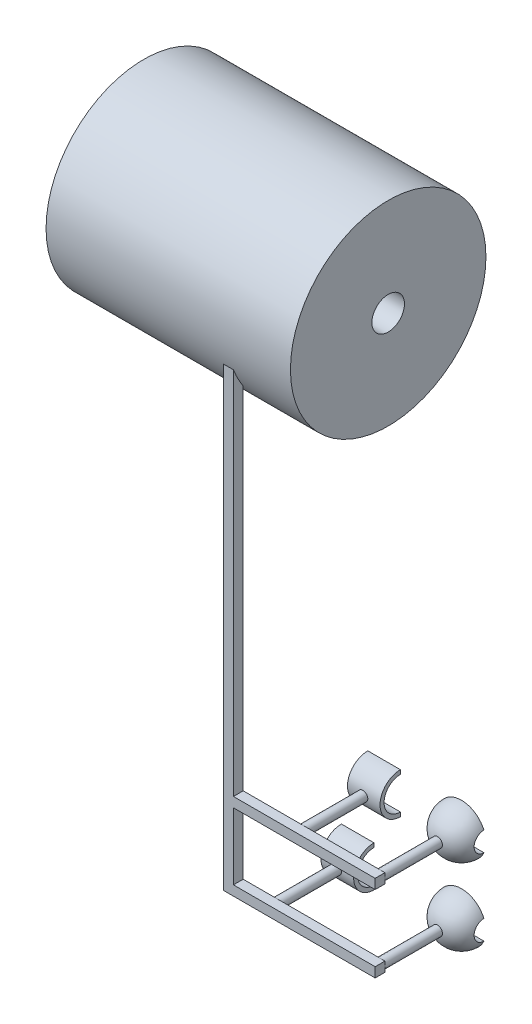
ISO-10303-21;
HEADER;
FILE_DESCRIPTION(('STEP AP214'),'2;1');
FILE_NAME('part.step','',(''),(''),'','','');
FILE_SCHEMA(('AUTOMOTIVE_DESIGN { 1 0 10303 214 1 1 1 1 }'));
ENDSEC;
DATA;
#1=APPLICATION_CONTEXT('core data for automotive mechanical design processes');
#2=APPLICATION_PROTOCOL_DEFINITION('international standard','automotive_design',2000,#1);
#3=PRODUCT_CONTEXT('',#1,'mechanical');
#4=PRODUCT('Part','Part','',(#3));
#5=PRODUCT_RELATED_PRODUCT_CATEGORY('part','',(#4));
#6=PRODUCT_DEFINITION_FORMATION('','',#4);
#7=PRODUCT_DEFINITION_CONTEXT('part definition',#1,'design');
#8=PRODUCT_DEFINITION('design','',#6,#7);
#9=PRODUCT_DEFINITION_SHAPE('','',#8);
#10=(LENGTH_UNIT() NAMED_UNIT(*) SI_UNIT(.MILLI.,.METRE.));
#11=(NAMED_UNIT(*) PLANE_ANGLE_UNIT() SI_UNIT($,.RADIAN.));
#12=(NAMED_UNIT(*) SI_UNIT($,.STERADIAN.) SOLID_ANGLE_UNIT());
#13=UNCERTAINTY_MEASURE_WITH_UNIT(LENGTH_MEASURE(1.E-05),#10,'distance_accuracy_value','');
#14=(GEOMETRIC_REPRESENTATION_CONTEXT(3) GLOBAL_UNCERTAINTY_ASSIGNED_CONTEXT((#13)) GLOBAL_UNIT_ASSIGNED_CONTEXT((#10,
#11,#12)) REPRESENTATION_CONTEXT('',''));
#15=CARTESIAN_POINT('',(0.,0.,0.));
#16=DIRECTION('',(0.,0.,1.));
#17=DIRECTION('',(1.,0.,0.));
#18=AXIS2_PLACEMENT_3D('',#15,#16,#17);
#19=CARTESIAN_POINT('',(0.,-47.,0.));
#20=DIRECTION('',(0.,0.,-1.));
#21=DIRECTION('',(-1.,0.,0.));
#22=AXIS2_PLACEMENT_3D('',#19,#20,#21);
#23=PLANE('',#22);
#24=DIRECTION('',(1.,0.,0.));
#25=VECTOR('',#24,1.);
#26=CARTESIAN_POINT('',(-195.,-41.,-1.36167772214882E-12));
#27=LINE('',#26,#25);
#28=CARTESIAN_POINT('',(-13.7477270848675,-41.,0.));
#29=VERTEX_POINT('',#28);
#30=CARTESIAN_POINT('',(-8.,-41.,0.));
#31=VERTEX_POINT('',#30);
#32=EDGE_CURVE('E12',#29,#31,#27,.T.);
#33=ORIENTED_EDGE('',*,*,#32,.F.);
#34=CARTESIAN_POINT('',(0.,-47.,0.));
#35=DIRECTION('',(0.,0.,-1.));
#36=DIRECTION('',(-1.,0.,0.));
#37=AXIS2_PLACEMENT_3D('',#34,#35,#36);
#38=CIRCLE('',#37,15.);
#39=CARTESIAN_POINT('',(13.7477270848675,-41.,0.));
#40=VERTEX_POINT('',#39);
#41=EDGE_CURVE('E212',#29,#40,#38,.T.);
#42=ORIENTED_EDGE('',*,*,#41,.T.);
#43=CARTESIAN_POINT('',(8.,-41.,0.));
#44=VERTEX_POINT('',#43);
#45=EDGE_CURVE('E48',#44,#40,#27,.T.);
#46=ORIENTED_EDGE('',*,*,#45,.F.);
#47=CARTESIAN_POINT('',(0.,-47.,0.));
#48=DIRECTION('',(0.,0.,1.));
#49=DIRECTION('',(-1.,0.,0.));
#50=AXIS2_PLACEMENT_3D('',#47,#48,#49);
#51=CIRCLE('',#50,10.);
#52=EDGE_CURVE('E218',#44,#31,#51,.T.);
#53=ORIENTED_EDGE('',*,*,#52,.T.);
#54=EDGE_LOOP('',(#33,#42,#46,#53));
#55=FACE_BOUND('',#54,.T.);
#56=ADVANCED_FACE('F44',(#55),#23,.T.);
#57=CARTESIAN_POINT('',(0.,0.,0.));
#58=DIRECTION('',(0.,0.,-1.));
#59=DIRECTION('',(-1.,0.,0.));
#60=AXIS2_PLACEMENT_3D('',#57,#58,#59);
#61=PLANE('',#60);
#62=DIRECTION('',(1.,0.,0.));
#63=VECTOR('',#62,1.);
#64=CARTESIAN_POINT('',(-195.,6.,1.36167772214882E-12));
#65=LINE('',#64,#63);
#66=CARTESIAN_POINT('',(-13.7477270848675,6.,0.));
#67=VERTEX_POINT('',#66);
#68=CARTESIAN_POINT('',(-8.,6.,0.));
#69=VERTEX_POINT('',#68);
#70=EDGE_CURVE('E205',#67,#69,#65,.T.);
#71=ORIENTED_EDGE('',*,*,#70,.F.);
#72=CARTESIAN_POINT('',(0.,0.,0.));
#73=DIRECTION('',(0.,0.,-1.));
#74=DIRECTION('',(-1.,0.,0.));
#75=AXIS2_PLACEMENT_3D('',#72,#73,#74);
#76=CIRCLE('',#75,15.);
#77=CARTESIAN_POINT('',(13.7477270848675,6.,0.));
#78=VERTEX_POINT('',#77);
#79=EDGE_CURVE('E234',#67,#78,#76,.T.);
#80=ORIENTED_EDGE('',*,*,#79,.T.);
#81=CARTESIAN_POINT('',(8.,6.,0.));
#82=VERTEX_POINT('',#81);
#83=EDGE_CURVE('E348',#82,#78,#65,.T.);
#84=ORIENTED_EDGE('',*,*,#83,.F.);
#85=CARTESIAN_POINT('',(0.,0.,0.));
#86=DIRECTION('',(0.,0.,1.));
#87=DIRECTION('',(-1.,0.,0.));
#88=AXIS2_PLACEMENT_3D('',#85,#86,#87);
#89=CIRCLE('',#88,10.);
#90=EDGE_CURVE('E233',#82,#69,#89,.T.);
#91=ORIENTED_EDGE('',*,*,#90,.T.);
#92=EDGE_LOOP('',(#71,#80,#84,#91));
#93=FACE_BOUND('',#92,.T.);
#94=ADVANCED_FACE('F450',(#93),#61,.T.);
#95=CARTESIAN_POINT('',(3.,251.37,50.));
#96=DIRECTION('',(0.,0.,1.));
#97=DIRECTION('',(1.,0.,0.));
#98=AXIS2_PLACEMENT_3D('',#95,#96,#97);
#99=PLANE('',#98);
#100=DIRECTION('',(-1.,0.,0.));
#101=VECTOR('',#100,1.);
#102=CARTESIAN_POINT('',(3.,3.,50.));
#103=LINE('',#102,#101);
#104=CARTESIAN_POINT('',(-47.5,3.,50.));
#105=VERTEX_POINT('',#104);
#106=CARTESIAN_POINT('',(-84.,2.99999999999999,50.));
#107=VERTEX_POINT('',#106);
#108=EDGE_CURVE('E243',#105,#107,#103,.T.);
#109=ORIENTED_EDGE('',*,*,#108,.F.);
#110=CARTESIAN_POINT('',(-47.5,0.,50.));
#111=DIRECTION('',(0.,0.,1.));
#112=DIRECTION('',(1.,0.,0.));
#113=AXIS2_PLACEMENT_3D('',#110,#111,#112);
#114=CIRCLE('',#113,3.);
#115=CARTESIAN_POINT('',(-47.5,-3.00000000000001,50.));
#116=VERTEX_POINT('',#115);
#117=EDGE_CURVE('E387',#105,#116,#114,.T.);
#118=ORIENTED_EDGE('',*,*,#117,.T.);
#119=DIRECTION('',(1.,0.,0.));
#120=VECTOR('',#119,1.);
#121=CARTESIAN_POINT('',(3.,-3.,50.));
#122=LINE('',#121,#120);
#123=CARTESIAN_POINT('',(-84.,-3.00000000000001,50.));
#124=VERTEX_POINT('',#123);
#125=EDGE_CURVE('E270',#124,#116,#122,.T.);
#126=ORIENTED_EDGE('',*,*,#125,.F.);
#127=DIRECTION('',(0.,1.,0.));
#128=VECTOR('',#127,1.);
#129=CARTESIAN_POINT('',(-84.,-44.,50.));
#130=LINE('',#129,#128);
#131=CARTESIAN_POINT('',(-84.,-44.,50.));
#132=VERTEX_POINT('',#131);
#133=EDGE_CURVE('E266',#132,#124,#130,.T.);
#134=ORIENTED_EDGE('',*,*,#133,.F.);
#135=DIRECTION('',(-1.,0.,0.));
#136=VECTOR('',#135,1.);
#137=CARTESIAN_POINT('',(3.00000000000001,-44.,50.));
#138=LINE('',#137,#136);
#139=CARTESIAN_POINT('',(-63.7,-44.,50.));
#140=VERTEX_POINT('',#139);
#141=EDGE_CURVE('E262',#140,#132,#138,.T.);
#142=ORIENTED_EDGE('',*,*,#141,.F.);
#143=CARTESIAN_POINT('',(-63.7,-47.,50.));
#144=DIRECTION('',(0.,0.,1.));
#145=DIRECTION('',(1.,0.,0.));
#146=AXIS2_PLACEMENT_3D('',#143,#144,#145);
#147=CIRCLE('',#146,3.00000000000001);
#148=CARTESIAN_POINT('',(-63.7,-50.,50.));
#149=VERTEX_POINT('',#148);
#150=EDGE_CURVE('E394',#140,#149,#147,.T.);
#151=ORIENTED_EDGE('',*,*,#150,.T.);
#152=DIRECTION('',(1.,0.,0.));
#153=VECTOR('',#152,1.);
#154=CARTESIAN_POINT('',(3.00000000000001,-50.,50.));
#155=LINE('',#154,#153);
#156=CARTESIAN_POINT('',(-90.,-50.,50.));
#157=VERTEX_POINT('',#156);
#158=EDGE_CURVE('E254',#157,#149,#155,.T.);
#159=ORIENTED_EDGE('',*,*,#158,.F.);
#160=DIRECTION('',(0.,-1.,0.));
#161=VECTOR('',#160,1.);
#162=CARTESIAN_POINT('',(-90.,-50.,50.));
#163=LINE('',#162,#161);
#164=CARTESIAN_POINT('',(-90.,218.203752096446,50.));
#165=VERTEX_POINT('',#164);
#166=EDGE_CURVE('E251',#165,#157,#163,.T.);
#167=ORIENTED_EDGE('',*,*,#166,.F.);
#168=DIRECTION('',(1.,0.,0.));
#169=VECTOR('',#168,1.);
#170=CARTESIAN_POINT('',(0.,218.203752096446,50.));
#171=LINE('',#170,#169);
#172=CARTESIAN_POINT('',(-84.,218.203752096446,50.));
#173=VERTEX_POINT('',#172);
#174=EDGE_CURVE('E330',#173,#165,#171,.F.);
#175=ORIENTED_EDGE('',*,*,#174,.F.);
#176=DIRECTION('',(0.,1.,0.));
#177=VECTOR('',#176,1.);
#178=CARTESIAN_POINT('',(-84.,2.99999999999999,50.));
#179=LINE('',#178,#177);
#180=EDGE_CURVE('E247',#107,#173,#179,.T.);
#181=ORIENTED_EDGE('',*,*,#180,.F.);
#182=EDGE_LOOP('',(#109,#118,#126,#134,#142,#151,#159,#167,#175,#181));
#183=FACE_BOUND('',#182,.T.);
#184=ADVANCED_FACE('F455',(#183),#99,.F.);
#185=CARTESIAN_POINT('',(0.,-3.,50.));
#186=VERTEX_POINT('',#185);
#187=EDGE_CURVE('E274',#116,#186,#122,.T.);
#188=ORIENTED_EDGE('',*,*,#187,.F.);
#189=EDGE_CURVE('E366',#116,#105,#114,.T.);
#190=ORIENTED_EDGE('',*,*,#189,.T.);
#191=CARTESIAN_POINT('',(0.,3.,50.));
#192=VERTEX_POINT('',#191);
#193=EDGE_CURVE('E248',#192,#105,#103,.T.);
#194=ORIENTED_EDGE('',*,*,#193,.F.);
#195=CARTESIAN_POINT('',(0.,0.,50.));
#196=DIRECTION('',(0.,0.,1.));
#197=DIRECTION('',(1.,0.,0.));
#198=AXIS2_PLACEMENT_3D('',#195,#196,#197);
#199=CIRCLE('',#198,3.);
#200=EDGE_CURVE('E344',#192,#186,#199,.T.);
#201=ORIENTED_EDGE('',*,*,#200,.T.);
#202=EDGE_LOOP('',(#188,#190,#194,#201));
#203=FACE_BOUND('',#202,.T.);
#204=ADVANCED_FACE('F590',(#203),#99,.F.);
#205=DIRECTION('',(0.,1.,0.));
#206=VECTOR('',#205,1.);
#207=CARTESIAN_POINT('',(3.00000000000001,-50.,50.));
#208=LINE('',#207,#206);
#209=CARTESIAN_POINT('',(3.00000000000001,-47.,50.));
#210=VERTEX_POINT('',#209);
#211=CARTESIAN_POINT('',(3.00000000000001,-44.,50.));
#212=VERTEX_POINT('',#211);
#213=EDGE_CURVE('E257',#210,#212,#208,.T.);
#214=ORIENTED_EDGE('',*,*,#213,.F.);
#215=CARTESIAN_POINT('',(0.,-47.,50.));
#216=DIRECTION('',(0.,0.,1.));
#217=DIRECTION('',(1.,0.,0.));
#218=AXIS2_PLACEMENT_3D('',#215,#216,#217);
#219=CIRCLE('',#218,3.);
#220=CARTESIAN_POINT('',(0.,-44.,50.));
#221=VERTEX_POINT('',#220);
#222=EDGE_CURVE('E225',#210,#221,#219,.T.);
#223=ORIENTED_EDGE('',*,*,#222,.T.);
#224=EDGE_CURVE('E263',#212,#221,#138,.T.);
#225=ORIENTED_EDGE('',*,*,#224,.F.);
#226=EDGE_LOOP('',(#214,#223,#225));
#227=FACE_BOUND('',#226,.T.);
#228=ADVANCED_FACE('F414',(#227),#99,.F.);
#229=CARTESIAN_POINT('',(0.,-50.,50.));
#230=VERTEX_POINT('',#229);
#231=EDGE_CURVE('E258',#149,#230,#155,.T.);
#232=ORIENTED_EDGE('',*,*,#231,.F.);
#233=EDGE_CURVE('E393',#149,#140,#147,.T.);
#234=ORIENTED_EDGE('',*,*,#233,.T.);
#235=EDGE_CURVE('E267',#221,#140,#138,.T.);
#236=ORIENTED_EDGE('',*,*,#235,.F.);
#237=EDGE_CURVE('E401',#221,#230,#219,.T.);
#238=ORIENTED_EDGE('',*,*,#237,.T.);
#239=EDGE_LOOP('',(#232,#234,#236,#238));
#240=FACE_BOUND('',#239,.T.);
#241=ADVANCED_FACE('F427',(#240),#99,.F.);
#242=DIRECTION('',(0.,1.,0.));
#243=VECTOR('',#242,1.);
#244=CARTESIAN_POINT('',(3.,-3.,50.));
#245=LINE('',#244,#243);
#246=CARTESIAN_POINT('',(3.,0.,50.));
#247=VERTEX_POINT('',#246);
#248=CARTESIAN_POINT('',(3.,3.,50.));
#249=VERTEX_POINT('',#248);
#250=EDGE_CURVE('E237',#247,#249,#245,.T.);
#251=ORIENTED_EDGE('',*,*,#250,.F.);
#252=CARTESIAN_POINT('',(0.,0.,50.));
#253=DIRECTION('',(0.,0.,1.));
#254=DIRECTION('',(1.,0.,0.));
#255=AXIS2_PLACEMENT_3D('',#252,#253,#254);
#256=CIRCLE('',#255,3.);
#257=EDGE_CURVE('E217',#247,#192,#256,.T.);
#258=ORIENTED_EDGE('',*,*,#257,.T.);
#259=EDGE_CURVE('E244',#249,#192,#103,.T.);
#260=ORIENTED_EDGE('',*,*,#259,.F.);
#261=EDGE_LOOP('',(#251,#258,#260));
#262=FACE_BOUND('',#261,.T.);
#263=ADVANCED_FACE('F610',(#262),#99,.F.);
#264=CARTESIAN_POINT('',(3.00000000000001,-50.,50.));
#265=VERTEX_POINT('',#264);
#266=EDGE_CURVE('E253',#230,#265,#155,.T.);
#267=ORIENTED_EDGE('',*,*,#266,.F.);
#268=EDGE_CURVE('E399',#230,#210,#219,.T.);
#269=ORIENTED_EDGE('',*,*,#268,.T.);
#270=EDGE_CURVE('E259',#265,#210,#208,.T.);
#271=ORIENTED_EDGE('',*,*,#270,.F.);
#272=EDGE_LOOP('',(#267,#269,#271));
#273=FACE_BOUND('',#272,.T.);
#274=ADVANCED_FACE('F412',(#273),#99,.F.);
#275=CARTESIAN_POINT('',(-45.,251.37,0.));
#276=DIRECTION('',(1.,0.,0.));
#277=DIRECTION('',(0.,0.,-1.));
#278=AXIS2_PLACEMENT_3D('',#275,#276,#277);
#279=PLANE('',#278);
#280=CARTESIAN_POINT('',(-45.,251.37,0.));
#281=DIRECTION('',(1.,0.,0.));
#282=DIRECTION('',(0.,0.,-1.));
#283=AXIS2_PLACEMENT_3D('',#280,#281,#282);
#284=CIRCLE('',#283,10.);
#285=CARTESIAN_POINT('',(-45.,251.37,-10.));
#286=VERTEX_POINT('',#285);
#287=EDGE_CURVE('E318',#286,#286,#284,.T.);
#288=ORIENTED_EDGE('',*,*,#287,.F.);
#289=EDGE_LOOP('',(#288));
#290=FACE_BOUND('',#289,.T.);
#291=CARTESIAN_POINT('',(-45.,251.37,0.));
#292=DIRECTION('',(1.,0.,0.));
#293=DIRECTION('',(0.,0.,-1.));
#294=AXIS2_PLACEMENT_3D('',#291,#292,#293);
#295=CIRCLE('',#294,60.);
#296=CARTESIAN_POINT('',(-45.,251.37,-60.));
#297=VERTEX_POINT('',#296);
#298=EDGE_CURVE('E327',#297,#297,#295,.T.);
#299=ORIENTED_EDGE('',*,*,#298,.T.);
#300=EDGE_LOOP('',(#299));
#301=FACE_BOUND('',#300,.T.);
#302=ADVANCED_FACE('F46',(#290,#301),#279,.T.);
#303=CARTESIAN_POINT('',(0.,251.37,0.));
#304=DIRECTION('',(1.,0.,0.));
#305=DIRECTION('',(0.,0.,-1.));
#306=AXIS2_PLACEMENT_3D('',#303,#304,#305);
#307=CYLINDRICAL_SURFACE('',#306,60.);
#308=DIRECTION('',(1.,0.,0.));
#309=VECTOR('',#308,1.);
#310=CARTESIAN_POINT('',(0.,229.829340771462,56.));
#311=LINE('',#310,#309);
#312=CARTESIAN_POINT('',(-84.,229.829340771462,56.));
#313=VERTEX_POINT('',#312);
#314=CARTESIAN_POINT('',(-90.,229.829340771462,56.));
#315=VERTEX_POINT('',#314);
#316=EDGE_CURVE('E339',#313,#315,#311,.F.);
#317=ORIENTED_EDGE('',*,*,#316,.F.);
#318=CARTESIAN_POINT('',(-84.,251.37,0.));
#319=DIRECTION('',(-1.,0.,0.));
#320=DIRECTION('',(0.,0.,1.));
#321=AXIS2_PLACEMENT_3D('',#318,#319,#320);
#322=CIRCLE('',#321,60.);
#323=EDGE_CURVE('E336',#313,#173,#322,.F.);
#324=ORIENTED_EDGE('',*,*,#323,.T.);
#325=ORIENTED_EDGE('',*,*,#174,.T.);
#326=CARTESIAN_POINT('',(-90.,251.37,0.));
#327=DIRECTION('',(1.,0.,0.));
#328=DIRECTION('',(0.,0.,-1.));
#329=AXIS2_PLACEMENT_3D('',#326,#327,#328);
#330=CIRCLE('',#329,60.);
#331=EDGE_CURVE('E333',#165,#315,#330,.F.);
#332=ORIENTED_EDGE('',*,*,#331,.T.);
#333=EDGE_LOOP('',(#317,#324,#325,#332));
#334=FACE_BOUND('',#333,.T.);
#335=CARTESIAN_POINT('',(-195.,251.37,0.));
#336=DIRECTION('',(1.,0.,0.));
#337=DIRECTION('',(0.,0.,-1.));
#338=AXIS2_PLACEMENT_3D('',#335,#336,#337);
#339=CIRCLE('',#338,60.);
#340=CARTESIAN_POINT('',(-195.,251.37,-60.));
#341=VERTEX_POINT('',#340);
#342=EDGE_CURVE('E324',#341,#341,#339,.T.);
#343=ORIENTED_EDGE('',*,*,#342,.T.);
#344=EDGE_LOOP('',(#343));
#345=FACE_BOUND('',#344,.T.);
#346=ORIENTED_EDGE('',*,*,#298,.F.);
#347=EDGE_LOOP('',(#346));
#348=FACE_BOUND('',#347,.T.);
#349=ADVANCED_FACE('F628',(#334,#345,#348),#307,.T.);
#350=CARTESIAN_POINT('',(-195.,251.37,0.));
#351=DIRECTION('',(-1.,0.,0.));
#352=DIRECTION('',(0.,0.,1.));
#353=AXIS2_PLACEMENT_3D('',#350,#351,#352);
#354=PLANE('',#353);
#355=ORIENTED_EDGE('',*,*,#342,.F.);
#356=EDGE_LOOP('',(#355));
#357=FACE_BOUND('',#356,.T.);
#358=ADVANCED_FACE('F636',(#357),#354,.T.);
#359=CARTESIAN_POINT('',(-65.,251.37,0.));
#360=DIRECTION('',(1.,0.,0.));
#361=DIRECTION('',(0.,0.,-1.));
#362=AXIS2_PLACEMENT_3D('',#359,#360,#361);
#363=CYLINDRICAL_SURFACE('',#362,10.);
#364=CARTESIAN_POINT('',(-65.,251.37,0.));
#365=DIRECTION('',(1.,0.,0.));
#366=DIRECTION('',(0.,0.,-1.));
#367=AXIS2_PLACEMENT_3D('',#364,#365,#366);
#368=CIRCLE('',#367,10.);
#369=CARTESIAN_POINT('',(-65.,251.37,-10.));
#370=VERTEX_POINT('',#369);
#371=EDGE_CURVE('E321',#370,#370,#368,.T.);
#372=ORIENTED_EDGE('',*,*,#371,.F.);
#373=EDGE_LOOP('',(#372));
#374=FACE_BOUND('',#373,.T.);
#375=ORIENTED_EDGE('',*,*,#287,.T.);
#376=EDGE_LOOP('',(#375));
#377=FACE_BOUND('',#376,.T.);
#378=ADVANCED_FACE('F643',(#374,#377),#363,.F.);
#379=CARTESIAN_POINT('',(-65.,251.37,0.));
#380=DIRECTION('',(1.,0.,0.));
#381=DIRECTION('',(0.,0.,-1.));
#382=AXIS2_PLACEMENT_3D('',#379,#380,#381);
#383=PLANE('',#382);
#384=ORIENTED_EDGE('',*,*,#371,.T.);
#385=EDGE_LOOP('',(#384));
#386=FACE_BOUND('',#385,.T.);
#387=ADVANCED_FACE('F650',(#386),#383,.T.);
#388=CARTESIAN_POINT('',(3.,-3.,56.));
#389=DIRECTION('',(-1.,0.,0.));
#390=DIRECTION('',(0.,0.,1.));
#391=AXIS2_PLACEMENT_3D('',#388,#389,#390);
#392=PLANE('',#391);
#393=CARTESIAN_POINT('',(3.,-3.,50.));
#394=VERTEX_POINT('',#393);
#395=EDGE_CURVE('E240',#394,#247,#245,.T.);
#396=ORIENTED_EDGE('',*,*,#395,.T.);
#397=ORIENTED_EDGE('',*,*,#250,.T.);
#398=DIRECTION('',(0.,0.,-1.));
#399=VECTOR('',#398,1.);
#400=CARTESIAN_POINT('',(3.,3.,56.));
#401=LINE('',#400,#399);
#402=CARTESIAN_POINT('',(3.,3.,56.));
#403=VERTEX_POINT('',#402);
#404=EDGE_CURVE('E315',#403,#249,#401,.T.);
#405=ORIENTED_EDGE('',*,*,#404,.F.);
#406=DIRECTION('',(0.,1.,0.));
#407=VECTOR('',#406,1.);
#408=CARTESIAN_POINT('',(3.,-3.,56.));
#409=LINE('',#408,#407);
#410=CARTESIAN_POINT('',(3.,-3.,56.));
#411=VERTEX_POINT('',#410);
#412=EDGE_CURVE('E273',#411,#403,#409,.T.);
#413=ORIENTED_EDGE('',*,*,#412,.F.);
#414=DIRECTION('',(0.,0.,-1.));
#415=VECTOR('',#414,1.);
#416=CARTESIAN_POINT('',(3.,-3.,56.));
#417=LINE('',#416,#415);
#418=EDGE_CURVE('E294',#411,#394,#417,.T.);
#419=ORIENTED_EDGE('',*,*,#418,.T.);
#420=EDGE_LOOP('',(#396,#397,#405,#413,#419));
#421=FACE_BOUND('',#420,.T.);
#422=ADVANCED_FACE('F657',(#421),#392,.F.);
#423=CARTESIAN_POINT('',(3.,3.,56.));
#424=DIRECTION('',(0.,-1.,0.));
#425=DIRECTION('',(1.,0.,0.));
#426=AXIS2_PLACEMENT_3D('',#423,#424,#425);
#427=PLANE('',#426);
#428=ORIENTED_EDGE('',*,*,#259,.T.);
#429=ORIENTED_EDGE('',*,*,#193,.T.);
#430=ORIENTED_EDGE('',*,*,#108,.T.);
#431=DIRECTION('',(0.,0.,-1.));
#432=VECTOR('',#431,1.);
#433=CARTESIAN_POINT('',(-84.,2.99999999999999,56.));
#434=LINE('',#433,#432);
#435=CARTESIAN_POINT('',(-84.,2.99999999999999,56.));
#436=VERTEX_POINT('',#435);
#437=EDGE_CURVE('E312',#436,#107,#434,.T.);
#438=ORIENTED_EDGE('',*,*,#437,.F.);
#439=DIRECTION('',(-1.,0.,0.));
#440=VECTOR('',#439,1.);
#441=CARTESIAN_POINT('',(3.,3.,56.));
#442=LINE('',#441,#440);
#443=EDGE_CURVE('E277',#403,#436,#442,.T.);
#444=ORIENTED_EDGE('',*,*,#443,.F.);
#445=ORIENTED_EDGE('',*,*,#404,.T.);
#446=EDGE_LOOP('',(#428,#429,#430,#438,#444,#445));
#447=FACE_BOUND('',#446,.T.);
#448=ADVANCED_FACE('F663',(#447),#427,.F.);
#449=CARTESIAN_POINT('',(-84.,2.99999999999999,56.));
#450=DIRECTION('',(-1.,0.,0.));
#451=DIRECTION('',(0.,0.,1.));
#452=AXIS2_PLACEMENT_3D('',#449,#450,#451);
#453=PLANE('',#452);
#454=ORIENTED_EDGE('',*,*,#323,.F.);
#455=DIRECTION('',(0.,1.,0.));
#456=VECTOR('',#455,1.);
#457=CARTESIAN_POINT('',(-84.,2.99999999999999,56.));
#458=LINE('',#457,#456);
#459=EDGE_CURVE('E279',#436,#313,#458,.T.);
#460=ORIENTED_EDGE('',*,*,#459,.F.);
#461=ORIENTED_EDGE('',*,*,#437,.T.);
#462=ORIENTED_EDGE('',*,*,#180,.T.);
#463=EDGE_LOOP('',(#454,#460,#461,#462));
#464=FACE_BOUND('',#463,.T.);
#465=ADVANCED_FACE('F671',(#464),#453,.F.);
#466=CARTESIAN_POINT('',(-90.,-50.,56.));
#467=DIRECTION('',(1.,0.,0.));
#468=DIRECTION('',(0.,0.,-1.));
#469=AXIS2_PLACEMENT_3D('',#466,#467,#468);
#470=PLANE('',#469);
#471=ORIENTED_EDGE('',*,*,#331,.F.);
#472=ORIENTED_EDGE('',*,*,#166,.T.);
#473=DIRECTION('',(0.,0.,-1.));
#474=VECTOR('',#473,1.);
#475=CARTESIAN_POINT('',(-90.,-50.,56.));
#476=LINE('',#475,#474);
#477=CARTESIAN_POINT('',(-90.,-50.,56.));
#478=VERTEX_POINT('',#477);
#479=EDGE_CURVE('E309',#478,#157,#476,.T.);
#480=ORIENTED_EDGE('',*,*,#479,.F.);
#481=DIRECTION('',(0.,-1.,0.));
#482=VECTOR('',#481,1.);
#483=CARTESIAN_POINT('',(-90.,-50.,56.));
#484=LINE('',#483,#482);
#485=EDGE_CURVE('E282',#315,#478,#484,.T.);
#486=ORIENTED_EDGE('',*,*,#485,.F.);
#487=EDGE_LOOP('',(#471,#472,#480,#486));
#488=FACE_BOUND('',#487,.T.);
#489=ADVANCED_FACE('F679',(#488),#470,.F.);
#490=CARTESIAN_POINT('',(3.00000000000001,-50.,56.));
#491=DIRECTION('',(0.,1.,0.));
#492=DIRECTION('',(-1.,0.,0.));
#493=AXIS2_PLACEMENT_3D('',#490,#491,#492);
#494=PLANE('',#493);
#495=ORIENTED_EDGE('',*,*,#158,.T.);
#496=ORIENTED_EDGE('',*,*,#231,.T.);
#497=ORIENTED_EDGE('',*,*,#266,.T.);
#498=DIRECTION('',(0.,0.,-1.));
#499=VECTOR('',#498,1.);
#500=CARTESIAN_POINT('',(3.00000000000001,-50.,56.));
#501=LINE('',#500,#499);
#502=CARTESIAN_POINT('',(3.00000000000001,-50.,56.));
#503=VERTEX_POINT('',#502);
#504=EDGE_CURVE('E306',#503,#265,#501,.T.);
#505=ORIENTED_EDGE('',*,*,#504,.F.);
#506=DIRECTION('',(1.,0.,0.));
#507=VECTOR('',#506,1.);
#508=CARTESIAN_POINT('',(3.00000000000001,-50.,56.));
#509=LINE('',#508,#507);
#510=EDGE_CURVE('E284',#478,#503,#509,.T.);
#511=ORIENTED_EDGE('',*,*,#510,.F.);
#512=ORIENTED_EDGE('',*,*,#479,.T.);
#513=EDGE_LOOP('',(#495,#496,#497,#505,#511,#512));
#514=FACE_BOUND('',#513,.T.);
#515=ADVANCED_FACE('F422',(#514),#494,.F.);
#516=CARTESIAN_POINT('',(3.00000000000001,-50.,56.));
#517=DIRECTION('',(-1.,0.,0.));
#518=DIRECTION('',(0.,0.,1.));
#519=AXIS2_PLACEMENT_3D('',#516,#517,#518);
#520=PLANE('',#519);
#521=ORIENTED_EDGE('',*,*,#270,.T.);
#522=ORIENTED_EDGE('',*,*,#213,.T.);
#523=DIRECTION('',(0.,0.,-1.));
#524=VECTOR('',#523,1.);
#525=CARTESIAN_POINT('',(3.00000000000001,-44.,56.));
#526=LINE('',#525,#524);
#527=CARTESIAN_POINT('',(3.00000000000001,-44.,56.));
#528=VERTEX_POINT('',#527);
#529=EDGE_CURVE('E303',#528,#212,#526,.T.);
#530=ORIENTED_EDGE('',*,*,#529,.F.);
#531=DIRECTION('',(0.,1.,0.));
#532=VECTOR('',#531,1.);
#533=CARTESIAN_POINT('',(3.00000000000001,-50.,56.));
#534=LINE('',#533,#532);
#535=EDGE_CURVE('E286',#503,#528,#534,.T.);
#536=ORIENTED_EDGE('',*,*,#535,.F.);
#537=ORIENTED_EDGE('',*,*,#504,.T.);
#538=EDGE_LOOP('',(#521,#522,#530,#536,#537));
#539=FACE_BOUND('',#538,.T.);
#540=ADVANCED_FACE('F417',(#539),#520,.F.);
#541=CARTESIAN_POINT('',(3.00000000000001,-44.,56.));
#542=DIRECTION('',(0.,-1.,0.));
#543=DIRECTION('',(1.,0.,0.));
#544=AXIS2_PLACEMENT_3D('',#541,#542,#543);
#545=PLANE('',#544);
#546=ORIENTED_EDGE('',*,*,#224,.T.);
#547=ORIENTED_EDGE('',*,*,#235,.T.);
#548=ORIENTED_EDGE('',*,*,#141,.T.);
#549=DIRECTION('',(0.,0.,-1.));
#550=VECTOR('',#549,1.);
#551=CARTESIAN_POINT('',(-84.,-44.,56.));
#552=LINE('',#551,#550);
#553=CARTESIAN_POINT('',(-84.,-44.,56.));
#554=VERTEX_POINT('',#553);
#555=EDGE_CURVE('E300',#554,#132,#552,.T.);
#556=ORIENTED_EDGE('',*,*,#555,.F.);
#557=DIRECTION('',(-1.,0.,0.));
#558=VECTOR('',#557,1.);
#559=CARTESIAN_POINT('',(3.00000000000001,-44.,56.));
#560=LINE('',#559,#558);
#561=EDGE_CURVE('E288',#528,#554,#560,.T.);
#562=ORIENTED_EDGE('',*,*,#561,.F.);
#563=ORIENTED_EDGE('',*,*,#529,.T.);
#564=EDGE_LOOP('',(#546,#547,#548,#556,#562,#563));
#565=FACE_BOUND('',#564,.T.);
#566=ADVANCED_FACE('F700',(#565),#545,.F.);
#567=CARTESIAN_POINT('',(-84.,-44.,56.));
#568=DIRECTION('',(-1.,0.,0.));
#569=DIRECTION('',(0.,0.,1.));
#570=AXIS2_PLACEMENT_3D('',#567,#568,#569);
#571=PLANE('',#570);
#572=ORIENTED_EDGE('',*,*,#133,.T.);
#573=DIRECTION('',(0.,0.,-1.));
#574=VECTOR('',#573,1.);
#575=CARTESIAN_POINT('',(-84.,-3.00000000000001,56.));
#576=LINE('',#575,#574);
#577=CARTESIAN_POINT('',(-84.,-3.00000000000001,56.));
#578=VERTEX_POINT('',#577);
#579=EDGE_CURVE('E297',#578,#124,#576,.T.);
#580=ORIENTED_EDGE('',*,*,#579,.F.);
#581=DIRECTION('',(0.,1.,0.));
#582=VECTOR('',#581,1.);
#583=CARTESIAN_POINT('',(-84.,-44.,56.));
#584=LINE('',#583,#582);
#585=EDGE_CURVE('E290',#554,#578,#584,.T.);
#586=ORIENTED_EDGE('',*,*,#585,.F.);
#587=ORIENTED_EDGE('',*,*,#555,.T.);
#588=EDGE_LOOP('',(#572,#580,#586,#587));
#589=FACE_BOUND('',#588,.T.);
#590=ADVANCED_FACE('F707',(#589),#571,.F.);
#591=CARTESIAN_POINT('',(3.,-3.,56.));
#592=DIRECTION('',(0.,1.,0.));
#593=DIRECTION('',(-1.,0.,0.));
#594=AXIS2_PLACEMENT_3D('',#591,#592,#593);
#595=PLANE('',#594);
#596=ORIENTED_EDGE('',*,*,#125,.T.);
#597=ORIENTED_EDGE('',*,*,#187,.T.);
#598=EDGE_CURVE('E269',#186,#394,#122,.T.);
#599=ORIENTED_EDGE('',*,*,#598,.T.);
#600=ORIENTED_EDGE('',*,*,#418,.F.);
#601=DIRECTION('',(1.,0.,0.));
#602=VECTOR('',#601,1.);
#603=CARTESIAN_POINT('',(3.,-3.,56.));
#604=LINE('',#603,#602);
#605=EDGE_CURVE('E292',#578,#411,#604,.T.);
#606=ORIENTED_EDGE('',*,*,#605,.F.);
#607=ORIENTED_EDGE('',*,*,#579,.T.);
#608=EDGE_LOOP('',(#596,#597,#599,#600,#606,#607));
#609=FACE_BOUND('',#608,.T.);
#610=ADVANCED_FACE('F715',(#609),#595,.F.);
#611=CARTESIAN_POINT('',(3.,251.37,56.));
#612=DIRECTION('',(0.,0.,1.));
#613=DIRECTION('',(1.,0.,0.));
#614=AXIS2_PLACEMENT_3D('',#611,#612,#613);
#615=PLANE('',#614);
#616=ORIENTED_EDGE('',*,*,#459,.T.);
#617=ORIENTED_EDGE('',*,*,#316,.T.);
#618=ORIENTED_EDGE('',*,*,#485,.T.);
#619=ORIENTED_EDGE('',*,*,#510,.T.);
#620=ORIENTED_EDGE('',*,*,#535,.T.);
#621=ORIENTED_EDGE('',*,*,#561,.T.);
#622=ORIENTED_EDGE('',*,*,#585,.T.);
#623=ORIENTED_EDGE('',*,*,#605,.T.);
#624=ORIENTED_EDGE('',*,*,#412,.T.);
#625=ORIENTED_EDGE('',*,*,#443,.T.);
#626=EDGE_LOOP('',(#616,#617,#618,#619,#620,#621,#622,#623,#624,#625));
#627=FACE_BOUND('',#626,.T.);
#628=ADVANCED_FACE('F723',(#627),#615,.T.);
#629=ORIENTED_EDGE('',*,*,#598,.F.);
#630=EDGE_CURVE('E341',#186,#247,#199,.T.);
#631=ORIENTED_EDGE('',*,*,#630,.T.);
#632=ORIENTED_EDGE('',*,*,#395,.F.);
#633=EDGE_LOOP('',(#629,#631,#632));
#634=FACE_BOUND('',#633,.T.);
#635=ADVANCED_FACE('F552',(#634),#99,.F.);
#636=CARTESIAN_POINT('',(0.,0.,0.));
#637=DIRECTION('',(0.,-1.,0.));
#638=DIRECTION('',(-1.,0.,0.));
#639=AXIS2_PLACEMENT_3D('',#636,#637,#638);
#640=SPHERICAL_SURFACE('',#639,10.);
#641=ORIENTED_EDGE('',*,*,#90,.F.);
#642=CARTESIAN_POINT('',(8.,0.,0.));
#643=DIRECTION('',(-1.,0.,0.));
#644=DIRECTION('',(0.,0.,1.));
#645=AXIS2_PLACEMENT_3D('',#642,#643,#644);
#646=CIRCLE('',#645,6.);
#647=CARTESIAN_POINT('',(8.,-6.,0.));
#648=VERTEX_POINT('',#647);
#649=EDGE_CURVE('E355',#82,#648,#646,.F.);
#650=ORIENTED_EDGE('',*,*,#649,.T.);
#651=CARTESIAN_POINT('',(-8.,-6.,0.));
#652=VERTEX_POINT('',#651);
#653=EDGE_CURVE('E229',#652,#648,#89,.T.);
#654=ORIENTED_EDGE('',*,*,#653,.F.);
#655=CARTESIAN_POINT('',(-8.,0.,0.));
#656=DIRECTION('',(1.,0.,0.));
#657=DIRECTION('',(0.,0.,-1.));
#658=AXIS2_PLACEMENT_3D('',#655,#656,#657);
#659=CIRCLE('',#658,6.);
#660=EDGE_CURVE('E375',#652,#69,#659,.F.);
#661=ORIENTED_EDGE('',*,*,#660,.T.);
#662=EDGE_LOOP('',(#641,#650,#654,#661));
#663=FACE_BOUND('',#662,.T.);
#664=ADVANCED_FACE('F363',(#663),#640,.F.);
#665=CARTESIAN_POINT('',(0.,0.,0.));
#666=DIRECTION('',(0.,-1.,0.));
#667=DIRECTION('',(1.,0.,0.));
#668=AXIS2_PLACEMENT_3D('',#665,#666,#667);
#669=SPHERICAL_SURFACE('',#668,15.);
#670=CARTESIAN_POINT('',(0.,0.,14.6969384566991));
#671=DIRECTION('',(0.,0.,-1.));
#672=DIRECTION('',(-1.,0.,0.));
#673=AXIS2_PLACEMENT_3D('',#670,#671,#672);
#674=CIRCLE('',#673,3.);
#675=CARTESIAN_POINT('',(-3.,0.,14.6969384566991));
#676=VERTEX_POINT('',#675);
#677=EDGE_CURVE('E228',#676,#676,#674,.T.);
#678=ORIENTED_EDGE('',*,*,#677,.T.);
#679=EDGE_LOOP('',(#678));
#680=FACE_BOUND('',#679,.T.);
#681=CARTESIAN_POINT('',(13.7477270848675,-6.,0.));
#682=VERTEX_POINT('',#681);
#683=CARTESIAN_POINT('',(-13.7477270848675,-6.,0.));
#684=VERTEX_POINT('',#683);
#685=EDGE_CURVE('E232',#682,#684,#76,.T.);
#686=ORIENTED_EDGE('',*,*,#685,.F.);
#687=CARTESIAN_POINT('',(13.7477270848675,0.,0.));
#688=DIRECTION('',(-1.,0.,0.));
#689=DIRECTION('',(0.,0.,1.));
#690=AXIS2_PLACEMENT_3D('',#687,#688,#689);
#691=CIRCLE('',#690,6.);
#692=EDGE_CURVE('E356',#682,#78,#691,.T.);
#693=ORIENTED_EDGE('',*,*,#692,.T.);
#694=ORIENTED_EDGE('',*,*,#79,.F.);
#695=CARTESIAN_POINT('',(-13.7477270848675,0.,0.));
#696=DIRECTION('',(1.,0.,0.));
#697=DIRECTION('',(0.,0.,-1.));
#698=AXIS2_PLACEMENT_3D('',#695,#696,#697);
#699=CIRCLE('',#698,6.);
#700=EDGE_CURVE('E373',#67,#684,#699,.T.);
#701=ORIENTED_EDGE('',*,*,#700,.T.);
#702=EDGE_LOOP('',(#686,#693,#694,#701));
#703=FACE_BOUND('',#702,.T.);
#704=ADVANCED_FACE('F378',(#680,#703),#669,.T.);
#705=DIRECTION('',(1.,0.,0.));
#706=VECTOR('',#705,1.);
#707=CARTESIAN_POINT('',(-195.,-6.,1.36167772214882E-12));
#708=LINE('',#707,#706);
#709=EDGE_CURVE('E347',#682,#648,#708,.F.);
#710=ORIENTED_EDGE('',*,*,#709,.F.);
#711=ORIENTED_EDGE('',*,*,#685,.T.);
#712=EDGE_CURVE('E345',#652,#684,#708,.F.);
#713=ORIENTED_EDGE('',*,*,#712,.F.);
#714=ORIENTED_EDGE('',*,*,#653,.T.);
#715=EDGE_LOOP('',(#710,#711,#713,#714));
#716=FACE_BOUND('',#715,.T.);
#717=ADVANCED_FACE('F369',(#716),#61,.T.);
#718=CARTESIAN_POINT('',(0.,0.,13.));
#719=DIRECTION('',(0.,0.,1.));
#720=DIRECTION('',(1.,0.,0.));
#721=AXIS2_PLACEMENT_3D('',#718,#719,#720);
#722=CYLINDRICAL_SURFACE('',#721,3.);
#723=ORIENTED_EDGE('',*,*,#257,.F.);
#724=ORIENTED_EDGE('',*,*,#630,.F.);
#725=ORIENTED_EDGE('',*,*,#200,.F.);
#726=EDGE_LOOP('',(#723,#724,#725));
#727=FACE_BOUND('',#726,.T.);
#728=ORIENTED_EDGE('',*,*,#677,.F.);
#729=EDGE_LOOP('',(#728));
#730=FACE_BOUND('',#729,.T.);
#731=ADVANCED_FACE('F445',(#727,#730),#722,.T.);
#732=CARTESIAN_POINT('',(0.,-47.,0.));
#733=DIRECTION('',(0.,1.,0.));
#734=DIRECTION('',(1.,0.,0.));
#735=AXIS2_PLACEMENT_3D('',#732,#733,#734);
#736=SPHERICAL_SURFACE('',#735,10.);
#737=ORIENTED_EDGE('',*,*,#52,.F.);
#738=CARTESIAN_POINT('',(8.,-47.,0.));
#739=DIRECTION('',(-1.,0.,0.));
#740=DIRECTION('',(0.,0.,1.));
#741=AXIS2_PLACEMENT_3D('',#738,#739,#740);
#742=CIRCLE('',#741,6.);
#743=CARTESIAN_POINT('',(8.00000000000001,-53.,0.));
#744=VERTEX_POINT('',#743);
#745=EDGE_CURVE('E379',#44,#744,#742,.F.);
#746=ORIENTED_EDGE('',*,*,#745,.T.);
#747=CARTESIAN_POINT('',(-8.,-53.,0.));
#748=VERTEX_POINT('',#747);
#749=EDGE_CURVE('E215',#748,#744,#51,.T.);
#750=ORIENTED_EDGE('',*,*,#749,.F.);
#751=CARTESIAN_POINT('',(-8.,-47.,0.));
#752=DIRECTION('',(1.,0.,0.));
#753=DIRECTION('',(0.,0.,-1.));
#754=AXIS2_PLACEMENT_3D('',#751,#752,#753);
#755=CIRCLE('',#754,6.);
#756=EDGE_CURVE('E58',#748,#31,#755,.F.);
#757=ORIENTED_EDGE('',*,*,#756,.T.);
#758=EDGE_LOOP('',(#737,#746,#750,#757));
#759=FACE_BOUND('',#758,.T.);
#760=ADVANCED_FACE('F438',(#759),#736,.F.);
#761=CARTESIAN_POINT('',(0.,-47.,0.));
#762=DIRECTION('',(0.,1.,0.));
#763=DIRECTION('',(-1.,0.,0.));
#764=AXIS2_PLACEMENT_3D('',#761,#762,#763);
#765=SPHERICAL_SURFACE('',#764,15.);
#766=CARTESIAN_POINT('',(0.,-47.,14.6969384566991));
#767=DIRECTION('',(0.,0.,-1.));
#768=DIRECTION('',(-1.,0.,0.));
#769=AXIS2_PLACEMENT_3D('',#766,#767,#768);
#770=CIRCLE('',#769,3.);
#771=CARTESIAN_POINT('',(-3.,-47.,14.6969384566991));
#772=VERTEX_POINT('',#771);
#773=EDGE_CURVE('E222',#772,#772,#770,.T.);
#774=ORIENTED_EDGE('',*,*,#773,.T.);
#775=EDGE_LOOP('',(#774));
#776=FACE_BOUND('',#775,.T.);
#777=CARTESIAN_POINT('',(13.7477270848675,-53.,0.));
#778=VERTEX_POINT('',#777);
#779=CARTESIAN_POINT('',(-13.7477270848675,-53.,0.));
#780=VERTEX_POINT('',#779);
#781=EDGE_CURVE('E210',#778,#780,#38,.T.);
#782=ORIENTED_EDGE('',*,*,#781,.F.);
#783=CARTESIAN_POINT('',(13.7477270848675,-47.,0.));
#784=DIRECTION('',(-1.,0.,0.));
#785=DIRECTION('',(0.,0.,1.));
#786=AXIS2_PLACEMENT_3D('',#783,#784,#785);
#787=CIRCLE('',#786,6.);
#788=EDGE_CURVE('E66',#778,#40,#787,.T.);
#789=ORIENTED_EDGE('',*,*,#788,.T.);
#790=ORIENTED_EDGE('',*,*,#41,.F.);
#791=CARTESIAN_POINT('',(-13.7477270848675,-47.,0.));
#792=DIRECTION('',(1.,0.,0.));
#793=DIRECTION('',(0.,0.,-1.));
#794=AXIS2_PLACEMENT_3D('',#791,#792,#793);
#795=CIRCLE('',#794,6.);
#796=EDGE_CURVE('E198',#29,#780,#795,.T.);
#797=ORIENTED_EDGE('',*,*,#796,.T.);
#798=EDGE_LOOP('',(#782,#789,#790,#797));
#799=FACE_BOUND('',#798,.T.);
#800=ADVANCED_FACE('F209',(#776,#799),#765,.T.);
#801=DIRECTION('',(1.,0.,0.));
#802=VECTOR('',#801,1.);
#803=CARTESIAN_POINT('',(-195.,-53.,-1.36167772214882E-12));
#804=LINE('',#803,#802);
#805=EDGE_CURVE('E204',#778,#744,#804,.F.);
#806=ORIENTED_EDGE('',*,*,#805,.F.);
#807=ORIENTED_EDGE('',*,*,#781,.T.);
#808=EDGE_CURVE('E195',#748,#780,#804,.F.);
#809=ORIENTED_EDGE('',*,*,#808,.F.);
#810=ORIENTED_EDGE('',*,*,#749,.T.);
#811=EDGE_LOOP('',(#806,#807,#809,#810));
#812=FACE_BOUND('',#811,.T.);
#813=ADVANCED_FACE('F214',(#812),#23,.T.);
#814=CARTESIAN_POINT('',(0.,-47.,13.));
#815=DIRECTION('',(0.,0.,1.));
#816=DIRECTION('',(1.,0.,0.));
#817=AXIS2_PLACEMENT_3D('',#814,#815,#816);
#818=CYLINDRICAL_SURFACE('',#817,3.);
#819=ORIENTED_EDGE('',*,*,#222,.F.);
#820=ORIENTED_EDGE('',*,*,#268,.F.);
#821=ORIENTED_EDGE('',*,*,#237,.F.);
#822=EDGE_LOOP('',(#819,#820,#821));
#823=FACE_BOUND('',#822,.T.);
#824=ORIENTED_EDGE('',*,*,#773,.F.);
#825=EDGE_LOOP('',(#824));
#826=FACE_BOUND('',#825,.T.);
#827=ADVANCED_FACE('F430',(#823,#826),#818,.T.);
#828=CARTESIAN_POINT('',(-63.7,-47.,13.));
#829=DIRECTION('',(0.,0.,1.));
#830=DIRECTION('',(1.,0.,0.));
#831=AXIS2_PLACEMENT_3D('',#828,#829,#830);
#832=CYLINDRICAL_SURFACE('',#831,3.00000000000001);
#833=CARTESIAN_POINT('',(-63.7,-47.,13.));
#834=DIRECTION('',(0.,0.,1.));
#835=DIRECTION('',(1.,0.,0.));
#836=AXIS2_PLACEMENT_3D('',#833,#834,#835);
#837=CIRCLE('',#836,3.00000000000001);
#838=CARTESIAN_POINT('',(-60.7,-47.,13.));
#839=VERTEX_POINT('',#838);
#840=EDGE_CURVE('E397',#839,#839,#837,.T.);
#841=ORIENTED_EDGE('',*,*,#840,.T.);
#842=EDGE_LOOP('',(#841));
#843=FACE_BOUND('',#842,.T.);
#844=ORIENTED_EDGE('',*,*,#150,.F.);
#845=ORIENTED_EDGE('',*,*,#233,.F.);
#846=EDGE_LOOP('',(#844,#845));
#847=FACE_BOUND('',#846,.T.);
#848=ADVANCED_FACE('F433',(#843,#847),#832,.T.);
#849=CARTESIAN_POINT('',(-63.7,-47.,13.));
#850=DIRECTION('',(0.,0.,1.));
#851=DIRECTION('',(1.,0.,0.));
#852=AXIS2_PLACEMENT_3D('',#849,#850,#851);
#853=PLANE('',#852);
#854=ORIENTED_EDGE('',*,*,#840,.F.);
#855=EDGE_LOOP('',(#854));
#856=FACE_BOUND('',#855,.T.);
#857=ADVANCED_FACE('F461',(#856),#853,.F.);
#858=CARTESIAN_POINT('',(-47.5,0.,13.));
#859=DIRECTION('',(0.,0.,1.));
#860=DIRECTION('',(1.,0.,0.));
#861=AXIS2_PLACEMENT_3D('',#858,#859,#860);
#862=CYLINDRICAL_SURFACE('',#861,3.);
#863=CARTESIAN_POINT('',(-47.5,0.,13.));
#864=DIRECTION('',(0.,0.,1.));
#865=DIRECTION('',(1.,0.,0.));
#866=AXIS2_PLACEMENT_3D('',#863,#864,#865);
#867=CIRCLE('',#866,3.);
#868=CARTESIAN_POINT('',(-44.5,0.,13.));
#869=VERTEX_POINT('',#868);
#870=EDGE_CURVE('E390',#869,#869,#867,.T.);
#871=ORIENTED_EDGE('',*,*,#870,.T.);
#872=EDGE_LOOP('',(#871));
#873=FACE_BOUND('',#872,.T.);
#874=ORIENTED_EDGE('',*,*,#117,.F.);
#875=ORIENTED_EDGE('',*,*,#189,.F.);
#876=EDGE_LOOP('',(#874,#875));
#877=FACE_BOUND('',#876,.T.);
#878=ADVANCED_FACE('F465',(#873,#877),#862,.T.);
#879=CARTESIAN_POINT('',(-47.5,0.,13.));
#880=DIRECTION('',(0.,0.,1.));
#881=DIRECTION('',(1.,0.,0.));
#882=AXIS2_PLACEMENT_3D('',#879,#880,#881);
#883=PLANE('',#882);
#884=ORIENTED_EDGE('',*,*,#870,.F.);
#885=EDGE_LOOP('',(#884));
#886=FACE_BOUND('',#885,.T.);
#887=ADVANCED_FACE('F469',(#886),#883,.F.);
#888=CARTESIAN_POINT('',(-195.,0.,0.));
#889=DIRECTION('',(1.,0.,0.));
#890=DIRECTION('',(0.,0.,-1.));
#891=AXIS2_PLACEMENT_3D('',#888,#889,#890);
#892=CYLINDRICAL_SURFACE('',#891,6.);
#893=ORIENTED_EDGE('',*,*,#70,.T.);
#894=ORIENTED_EDGE('',*,*,#660,.F.);
#895=ORIENTED_EDGE('',*,*,#712,.T.);
#896=ORIENTED_EDGE('',*,*,#700,.F.);
#897=EDGE_LOOP('',(#893,#894,#895,#896));
#898=FACE_BOUND('',#897,.T.);
#899=ADVANCED_FACE('F372',(#898),#892,.F.);
#900=ORIENTED_EDGE('',*,*,#83,.T.);
#901=ORIENTED_EDGE('',*,*,#692,.F.);
#902=ORIENTED_EDGE('',*,*,#709,.T.);
#903=ORIENTED_EDGE('',*,*,#649,.F.);
#904=EDGE_LOOP('',(#900,#901,#902,#903));
#905=FACE_BOUND('',#904,.T.);
#906=ADVANCED_FACE('F354',(#905),#892,.F.);
#907=CARTESIAN_POINT('',(-195.,-47.,0.));
#908=DIRECTION('',(1.,0.,0.));
#909=DIRECTION('',(0.,0.,-1.));
#910=AXIS2_PLACEMENT_3D('',#907,#908,#909);
#911=CYLINDRICAL_SURFACE('',#910,6.);
#912=ORIENTED_EDGE('',*,*,#32,.T.);
#913=ORIENTED_EDGE('',*,*,#756,.F.);
#914=ORIENTED_EDGE('',*,*,#808,.T.);
#915=ORIENTED_EDGE('',*,*,#796,.F.);
#916=EDGE_LOOP('',(#912,#913,#914,#915));
#917=FACE_BOUND('',#916,.T.);
#918=ADVANCED_FACE('F197',(#917),#911,.F.);
#919=ORIENTED_EDGE('',*,*,#45,.T.);
#920=ORIENTED_EDGE('',*,*,#788,.F.);
#921=ORIENTED_EDGE('',*,*,#805,.T.);
#922=ORIENTED_EDGE('',*,*,#745,.F.);
#923=EDGE_LOOP('',(#919,#920,#921,#922));
#924=FACE_BOUND('',#923,.T.);
#925=ADVANCED_FACE('F477',(#924),#911,.F.);
#926=CLOSED_SHELL('',(#56,#94,#184,#204,#228,#241,#263,#274,#302,#349,#358,#378,#387,#422,#448,
#465,#489,#515,#540,#566,#590,#610,#628,#635,#664,#704,#717,#731,#760,#800,#813,#827,#848,#857,
#878,#887,#899,#906,#918,#925));
#927=MANIFOLD_SOLID_BREP('B2',#926);
#928=CARTESIAN_POINT('',(-53.7,-59.5,0.));
#929=DIRECTION('',(-1.,0.,0.));
#930=DIRECTION('',(0.,-1.,0.));
#931=AXIS2_PLACEMENT_3D('',#928,#929,#930);
#932=PLANE('',#931);
#933=CARTESIAN_POINT('',(-53.7,-47.,0.));
#934=DIRECTION('',(-1.,0.,0.));
#935=DIRECTION('',(0.,-1.,0.));
#936=AXIS2_PLACEMENT_3D('',#933,#934,#935);
#937=CIRCLE('',#936,10.);
#938=CARTESIAN_POINT('',(-53.7,-57.,0.));
#939=VERTEX_POINT('',#938);
#940=CARTESIAN_POINT('',(-53.7,-37.,0.));
#941=VERTEX_POINT('',#940);
#942=EDGE_CURVE('E42',#939,#941,#937,.T.);
#943=ORIENTED_EDGE('',*,*,#942,.T.);
#944=DIRECTION('',(0.,1.,0.));
#945=VECTOR('',#944,1.);
#946=CARTESIAN_POINT('',(-53.7,-34.5,0.));
#947=LINE('',#946,#945);
#948=CARTESIAN_POINT('',(-53.7,-34.5,0.));
#949=VERTEX_POINT('',#948);
#950=EDGE_CURVE('E920',#941,#949,#947,.T.);
#951=ORIENTED_EDGE('',*,*,#950,.T.);
#952=CARTESIAN_POINT('',(-53.7,-47.,0.));
#953=DIRECTION('',(-1.,0.,0.));
#954=DIRECTION('',(0.,-1.,0.));
#955=AXIS2_PLACEMENT_3D('',#952,#953,#954);
#956=CIRCLE('',#955,12.5);
#957=CARTESIAN_POINT('',(-53.7,-59.5,0.));
#958=VERTEX_POINT('',#957);
#959=EDGE_CURVE('E902',#958,#949,#956,.T.);
#960=ORIENTED_EDGE('',*,*,#959,.F.);
#961=DIRECTION('',(0.,-1.,0.));
#962=VECTOR('',#961,1.);
#963=CARTESIAN_POINT('',(-53.7,-59.5,0.));
#964=LINE('',#963,#962);
#965=EDGE_CURVE('E928',#939,#958,#964,.T.);
#966=ORIENTED_EDGE('',*,*,#965,.F.);
#967=EDGE_LOOP('',(#943,#951,#960,#966));
#968=FACE_BOUND('',#967,.T.);
#969=ADVANCED_FACE('F862',(#968),#932,.F.);
#970=CARTESIAN_POINT('',(0.,-47.,0.));
#971=DIRECTION('',(-1.,0.,0.));
#972=DIRECTION('',(0.,-1.,0.));
#973=AXIS2_PLACEMENT_3D('',#970,#971,#972);
#974=CYLINDRICAL_SURFACE('',#973,10.);
#975=CARTESIAN_POINT('',(-73.7,-47.,0.));
#976=DIRECTION('',(-1.,0.,0.));
#977=DIRECTION('',(0.,-1.,0.));
#978=AXIS2_PLACEMENT_3D('',#975,#976,#977);
#979=CIRCLE('',#978,10.);
#980=CARTESIAN_POINT('',(-73.7,-57.,0.));
#981=VERTEX_POINT('',#980);
#982=CARTESIAN_POINT('',(-73.7,-37.,0.));
#983=VERTEX_POINT('',#982);
#984=EDGE_CURVE('E870',#981,#983,#979,.T.);
#985=ORIENTED_EDGE('',*,*,#984,.T.);
#986=DIRECTION('',(1.,0.,0.));
#987=VECTOR('',#986,1.);
#988=CARTESIAN_POINT('',(-53.7,-37.,0.));
#989=LINE('',#988,#987);
#990=EDGE_CURVE('E926',#983,#941,#989,.T.);
#991=ORIENTED_EDGE('',*,*,#990,.T.);
#992=ORIENTED_EDGE('',*,*,#942,.F.);
#993=DIRECTION('',(1.,0.,0.));
#994=VECTOR('',#993,1.);
#995=CARTESIAN_POINT('',(-53.7,-57.,0.));
#996=LINE('',#995,#994);
#997=EDGE_CURVE('E914',#981,#939,#996,.T.);
#998=ORIENTED_EDGE('',*,*,#997,.F.);
#999=EDGE_LOOP('',(#985,#991,#992,#998));
#1000=FACE_BOUND('',#999,.T.);
#1001=ADVANCED_FACE('F864',(#1000),#974,.F.);
#1002=CARTESIAN_POINT('',(-73.7,-59.5,0.));
#1003=DIRECTION('',(1.,0.,0.));
#1004=DIRECTION('',(0.,1.,0.));
#1005=AXIS2_PLACEMENT_3D('',#1002,#1003,#1004);
#1006=PLANE('',#1005);
#1007=CARTESIAN_POINT('',(-73.7,-47.,0.));
#1008=DIRECTION('',(-1.,0.,0.));
#1009=DIRECTION('',(0.,-1.,0.));
#1010=AXIS2_PLACEMENT_3D('',#1007,#1008,#1009);
#1011=CIRCLE('',#1010,12.5);
#1012=CARTESIAN_POINT('',(-73.7,-59.5,0.));
#1013=VERTEX_POINT('',#1012);
#1014=CARTESIAN_POINT('',(-73.7,-34.5,0.));
#1015=VERTEX_POINT('',#1014);
#1016=EDGE_CURVE('E913',#1013,#1015,#1011,.T.);
#1017=ORIENTED_EDGE('',*,*,#1016,.T.);
#1018=DIRECTION('',(0.,-1.,0.));
#1019=VECTOR('',#1018,1.);
#1020=CARTESIAN_POINT('',(-73.7,-34.5,0.));
#1021=LINE('',#1020,#1019);
#1022=EDGE_CURVE('E921',#1015,#983,#1021,.T.);
#1023=ORIENTED_EDGE('',*,*,#1022,.T.);
#1024=ORIENTED_EDGE('',*,*,#984,.F.);
#1025=DIRECTION('',(0.,1.,0.));
#1026=VECTOR('',#1025,1.);
#1027=CARTESIAN_POINT('',(-73.7,-59.5,0.));
#1028=LINE('',#1027,#1026);
#1029=EDGE_CURVE('E931',#1013,#981,#1028,.T.);
#1030=ORIENTED_EDGE('',*,*,#1029,.F.);
#1031=EDGE_LOOP('',(#1017,#1023,#1024,#1030));
#1032=FACE_BOUND('',#1031,.T.);
#1033=ADVANCED_FACE('F934',(#1032),#1006,.F.);
#1034=CARTESIAN_POINT('',(0.,-47.,0.));
#1035=DIRECTION('',(-1.,0.,0.));
#1036=DIRECTION('',(0.,-1.,0.));
#1037=AXIS2_PLACEMENT_3D('',#1034,#1035,#1036);
#1038=CYLINDRICAL_SURFACE('',#1037,12.5);
#1039=DIRECTION('',(-1.,0.,0.));
#1040=VECTOR('',#1039,1.);
#1041=CARTESIAN_POINT('',(-53.7,-59.5,0.));
#1042=LINE('',#1041,#1040);
#1043=EDGE_CURVE('E908',#958,#1013,#1042,.T.);
#1044=ORIENTED_EDGE('',*,*,#1043,.F.);
#1045=ORIENTED_EDGE('',*,*,#959,.T.);
#1046=DIRECTION('',(-1.,0.,0.));
#1047=VECTOR('',#1046,1.);
#1048=CARTESIAN_POINT('',(-53.7,-34.5,0.));
#1049=LINE('',#1048,#1047);
#1050=EDGE_CURVE('E905',#949,#1015,#1049,.T.);
#1051=ORIENTED_EDGE('',*,*,#1050,.T.);
#1052=ORIENTED_EDGE('',*,*,#1016,.F.);
#1053=EDGE_LOOP('',(#1044,#1045,#1051,#1052));
#1054=FACE_BOUND('',#1053,.T.);
#1055=ADVANCED_FACE('F904',(#1054),#1038,.T.);
#1056=CARTESIAN_POINT('',(-53.7,-57.,0.));
#1057=DIRECTION('',(0.,0.,1.));
#1058=DIRECTION('',(-1.,0.,0.));
#1059=AXIS2_PLACEMENT_3D('',#1056,#1057,#1058);
#1060=PLANE('',#1059);
#1061=ORIENTED_EDGE('',*,*,#965,.T.);
#1062=ORIENTED_EDGE('',*,*,#1043,.T.);
#1063=ORIENTED_EDGE('',*,*,#1029,.T.);
#1064=ORIENTED_EDGE('',*,*,#997,.T.);
#1065=EDGE_LOOP('',(#1061,#1062,#1063,#1064));
#1066=FACE_BOUND('',#1065,.T.);
#1067=ADVANCED_FACE('F936',(#1066),#1060,.F.);
#1068=CARTESIAN_POINT('',(-53.7,-37.,0.));
#1069=DIRECTION('',(0.,0.,-1.));
#1070=DIRECTION('',(-1.,0.,0.));
#1071=AXIS2_PLACEMENT_3D('',#1068,#1069,#1070);
#1072=PLANE('',#1071);
#1073=ORIENTED_EDGE('',*,*,#950,.F.);
#1074=ORIENTED_EDGE('',*,*,#990,.F.);
#1075=ORIENTED_EDGE('',*,*,#1022,.F.);
#1076=ORIENTED_EDGE('',*,*,#1050,.F.);
#1077=EDGE_LOOP('',(#1073,#1074,#1075,#1076));
#1078=FACE_BOUND('',#1077,.T.);
#1079=ADVANCED_FACE('F918',(#1078),#1072,.T.);
#1080=CLOSED_SHELL('',(#969,#1001,#1033,#1055,#1067,#1079));
#1081=MANIFOLD_SOLID_BREP('B6',#1080);
#1082=CARTESIAN_POINT('',(-57.5,-12.5,0.));
#1083=DIRECTION('',(1.,0.,0.));
#1084=DIRECTION('',(0.,0.,-1.));
#1085=AXIS2_PLACEMENT_3D('',#1082,#1083,#1084);
#1086=PLANE('',#1085);
#1087=CARTESIAN_POINT('',(-57.5,0.,0.));
#1088=DIRECTION('',(-1.,0.,0.));
#1089=DIRECTION('',(0.,0.,1.));
#1090=AXIS2_PLACEMENT_3D('',#1087,#1088,#1089);
#1091=CIRCLE('',#1090,9.99999999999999);
#1092=CARTESIAN_POINT('',(-57.5,-9.99999999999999,0.));
#1093=VERTEX_POINT('',#1092);
#1094=CARTESIAN_POINT('',(-57.5,9.99999999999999,0.));
#1095=VERTEX_POINT('',#1094);
#1096=EDGE_CURVE('E860',#1093,#1095,#1091,.T.);
#1097=ORIENTED_EDGE('',*,*,#1096,.F.);
#1098=DIRECTION('',(0.,1.,0.));
#1099=VECTOR('',#1098,1.);
#1100=CARTESIAN_POINT('',(-57.5,-12.5,0.));
#1101=LINE('',#1100,#1099);
#1102=CARTESIAN_POINT('',(-57.5,-12.5,0.));
#1103=VERTEX_POINT('',#1102);
#1104=EDGE_CURVE('E1048',#1103,#1093,#1101,.T.);
#1105=ORIENTED_EDGE('',*,*,#1104,.F.);
#1106=CARTESIAN_POINT('',(-57.5,0.,0.));
#1107=DIRECTION('',(-1.,0.,0.));
#1108=DIRECTION('',(0.,0.,1.));
#1109=AXIS2_PLACEMENT_3D('',#1106,#1107,#1108);
#1110=CIRCLE('',#1109,12.5);
#1111=CARTESIAN_POINT('',(-57.5,12.5,0.));
#1112=VERTEX_POINT('',#1111);
#1113=EDGE_CURVE('E1001',#1103,#1112,#1110,.T.);
#1114=ORIENTED_EDGE('',*,*,#1113,.T.);
#1115=DIRECTION('',(0.,-1.,0.));
#1116=VECTOR('',#1115,1.);
#1117=CARTESIAN_POINT('',(-57.5,12.5,0.));
#1118=LINE('',#1117,#1116);
#1119=EDGE_CURVE('E1037',#1112,#1095,#1118,.T.);
#1120=ORIENTED_EDGE('',*,*,#1119,.T.);
#1121=EDGE_LOOP('',(#1097,#1105,#1114,#1120));
#1122=FACE_BOUND('',#1121,.T.);
#1123=ADVANCED_FACE('F986',(#1122),#1086,.F.);
#1124=CARTESIAN_POINT('',(0.,0.,0.));
#1125=DIRECTION('',(-1.,0.,0.));
#1126=DIRECTION('',(0.,0.,1.));
#1127=AXIS2_PLACEMENT_3D('',#1124,#1125,#1126);
#1128=CYLINDRICAL_SURFACE('',#1127,9.99999999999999);
#1129=CARTESIAN_POINT('',(-37.5,0.,0.));
#1130=DIRECTION('',(-1.,0.,0.));
#1131=DIRECTION('',(0.,0.,1.));
#1132=AXIS2_PLACEMENT_3D('',#1129,#1130,#1131);
#1133=CIRCLE('',#1132,9.99999999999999);
#1134=CARTESIAN_POINT('',(-37.5,-9.99999999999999,0.));
#1135=VERTEX_POINT('',#1134);
#1136=CARTESIAN_POINT('',(-37.5,9.99999999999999,0.));
#1137=VERTEX_POINT('',#1136);
#1138=EDGE_CURVE('E994',#1135,#1137,#1133,.T.);
#1139=ORIENTED_EDGE('',*,*,#1138,.F.);
#1140=DIRECTION('',(1.,0.,0.));
#1141=VECTOR('',#1140,1.);
#1142=CARTESIAN_POINT('',(-57.5,-9.99999999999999,0.));
#1143=LINE('',#1142,#1141);
#1144=EDGE_CURVE('E1033',#1093,#1135,#1143,.T.);
#1145=ORIENTED_EDGE('',*,*,#1144,.F.);
#1146=ORIENTED_EDGE('',*,*,#1096,.T.);
#1147=DIRECTION('',(1.,0.,0.));
#1148=VECTOR('',#1147,1.);
#1149=CARTESIAN_POINT('',(-57.5,9.99999999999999,0.));
#1150=LINE('',#1149,#1148);
#1151=EDGE_CURVE('E1030',#1095,#1137,#1150,.T.);
#1152=ORIENTED_EDGE('',*,*,#1151,.T.);
#1153=EDGE_LOOP('',(#1139,#1145,#1146,#1152));
#1154=FACE_BOUND('',#1153,.T.);
#1155=ADVANCED_FACE('F988',(#1154),#1128,.F.);
#1156=CARTESIAN_POINT('',(-37.5,-12.5,0.));
#1157=DIRECTION('',(-1.,0.,0.));
#1158=DIRECTION('',(0.,0.,1.));
#1159=AXIS2_PLACEMENT_3D('',#1156,#1157,#1158);
#1160=PLANE('',#1159);
#1161=CARTESIAN_POINT('',(-37.5,0.,0.));
#1162=DIRECTION('',(-1.,0.,0.));
#1163=DIRECTION('',(0.,0.,1.));
#1164=AXIS2_PLACEMENT_3D('',#1161,#1162,#1163);
#1165=CIRCLE('',#1164,12.5);
#1166=CARTESIAN_POINT('',(-37.5,-12.5,0.));
#1167=VERTEX_POINT('',#1166);
#1168=CARTESIAN_POINT('',(-37.5,12.5,0.));
#1169=VERTEX_POINT('',#1168);
#1170=EDGE_CURVE('E1009',#1167,#1169,#1165,.T.);
#1171=ORIENTED_EDGE('',*,*,#1170,.F.);
#1172=DIRECTION('',(0.,-1.,0.));
#1173=VECTOR('',#1172,1.);
#1174=CARTESIAN_POINT('',(-37.5,-12.5,0.));
#1175=LINE('',#1174,#1173);
#1176=EDGE_CURVE('E1051',#1135,#1167,#1175,.T.);
#1177=ORIENTED_EDGE('',*,*,#1176,.F.);
#1178=ORIENTED_EDGE('',*,*,#1138,.T.);
#1179=DIRECTION('',(0.,1.,0.));
#1180=VECTOR('',#1179,1.);
#1181=CARTESIAN_POINT('',(-37.5,12.5,0.));
#1182=LINE('',#1181,#1180);
#1183=EDGE_CURVE('E1042',#1137,#1169,#1182,.T.);
#1184=ORIENTED_EDGE('',*,*,#1183,.T.);
#1185=EDGE_LOOP('',(#1171,#1177,#1178,#1184));
#1186=FACE_BOUND('',#1185,.T.);
#1187=ADVANCED_FACE('F1057',(#1186),#1160,.F.);
#1188=CARTESIAN_POINT('',(0.,0.,0.));
#1189=DIRECTION('',(-1.,0.,0.));
#1190=DIRECTION('',(0.,0.,1.));
#1191=AXIS2_PLACEMENT_3D('',#1188,#1189,#1190);
#1192=CYLINDRICAL_SURFACE('',#1191,12.5);
#1193=DIRECTION('',(-1.,0.,0.));
#1194=VECTOR('',#1193,1.);
#1195=CARTESIAN_POINT('',(-57.5,-12.5,0.));
#1196=LINE('',#1195,#1194);
#1197=EDGE_CURVE('E1053',#1167,#1103,#1196,.T.);
#1198=ORIENTED_EDGE('',*,*,#1197,.F.);
#1199=ORIENTED_EDGE('',*,*,#1170,.T.);
#1200=DIRECTION('',(-1.,0.,0.));
#1201=VECTOR('',#1200,1.);
#1202=CARTESIAN_POINT('',(-57.5,12.5,0.));
#1203=LINE('',#1202,#1201);
#1204=EDGE_CURVE('E1044',#1169,#1112,#1203,.T.);
#1205=ORIENTED_EDGE('',*,*,#1204,.T.);
#1206=ORIENTED_EDGE('',*,*,#1113,.F.);
#1207=EDGE_LOOP('',(#1198,#1199,#1205,#1206));
#1208=FACE_BOUND('',#1207,.T.);
#1209=ADVANCED_FACE('F1060',(#1208),#1192,.T.);
#1210=CARTESIAN_POINT('',(-57.5,-9.99999999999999,0.));
#1211=DIRECTION('',(0.,0.,-1.));
#1212=DIRECTION('',(1.,0.,0.));
#1213=AXIS2_PLACEMENT_3D('',#1210,#1211,#1212);
#1214=PLANE('',#1213);
#1215=ORIENTED_EDGE('',*,*,#1104,.T.);
#1216=ORIENTED_EDGE('',*,*,#1144,.T.);
#1217=ORIENTED_EDGE('',*,*,#1176,.T.);
#1218=ORIENTED_EDGE('',*,*,#1197,.T.);
#1219=EDGE_LOOP('',(#1215,#1216,#1217,#1218));
#1220=FACE_BOUND('',#1219,.T.);
#1221=ADVANCED_FACE('F1059',(#1220),#1214,.T.);
#1222=CARTESIAN_POINT('',(-57.5,9.99999999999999,0.));
#1223=DIRECTION('',(0.,0.,1.));
#1224=DIRECTION('',(1.,0.,0.));
#1225=AXIS2_PLACEMENT_3D('',#1222,#1223,#1224);
#1226=PLANE('',#1225);
#1227=ORIENTED_EDGE('',*,*,#1119,.F.);
#1228=ORIENTED_EDGE('',*,*,#1204,.F.);
#1229=ORIENTED_EDGE('',*,*,#1183,.F.);
#1230=ORIENTED_EDGE('',*,*,#1151,.F.);
#1231=EDGE_LOOP('',(#1227,#1228,#1229,#1230));
#1232=FACE_BOUND('',#1231,.T.);
#1233=ADVANCED_FACE('F1041',(#1232),#1226,.F.);
#1234=CLOSED_SHELL('',(#1123,#1155,#1187,#1209,#1221,#1233));
#1235=MANIFOLD_SOLID_BREP('B36',#1234);
#1236=ADVANCED_BREP_SHAPE_REPRESENTATION('',(#18,#927,#1081,#1235),#14);
#1237=SHAPE_DEFINITION_REPRESENTATION(#9,#1236);
ENDSEC;
END-ISO-10303-21;
